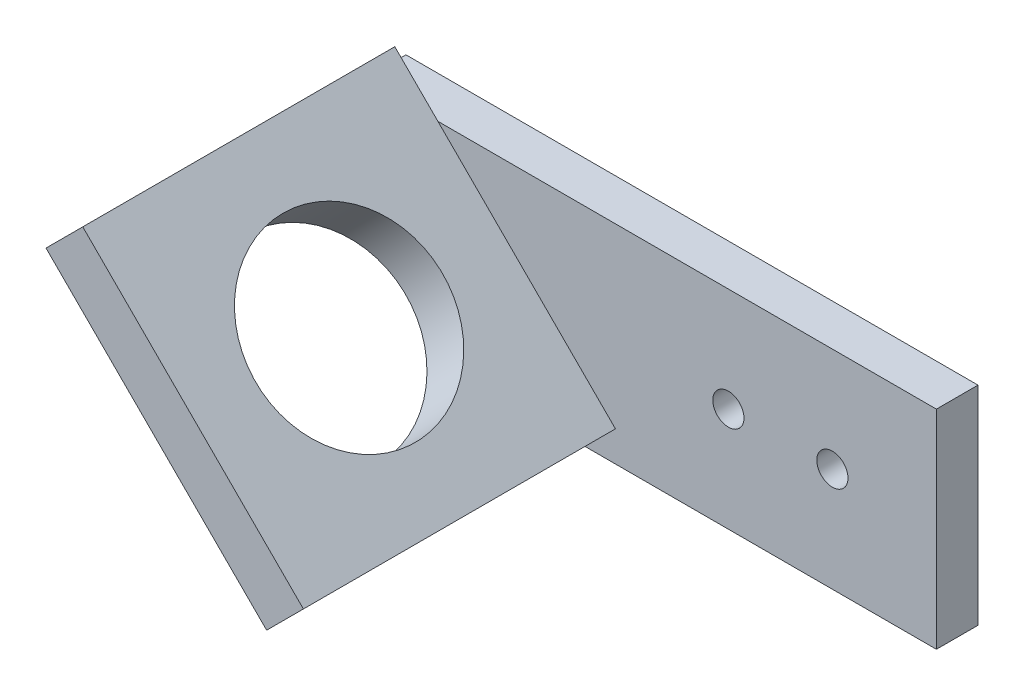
from build123d import *

# Parameters (mm, degrees)
SKETCH_1_W          = 80
SKETCH_1_H          = 20
EXTRUDE_1_DEPTH     = 4
EXTRUDE_2_DEPTH     = 30
SKETCH_3_R          = 9
CUT_EXTRUDE_1_DEPTH = 20
SKETCH_4_R          = 1.5
CUT_EXTRUDE_2_DEPTH = 20
CUT_EXTRUDE_3_DEPTH = 10


with BuildPart() as part:
    # Sketch 1 → Extrude 1 (new body)
    with BuildSketch(Plane.XY):
        Rectangle(SKETCH_1_W, SKETCH_1_H)
    extrude(amount=EXTRUDE_1_DEPTH)

    # Sketch 2 → Extrude 2 (add)
    with BuildSketch(Plane.XY.offset(4)):
        Polygon((-15.606601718, 10.606601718), (5.606601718, -10.606601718), (9.142135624, -7.071067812), (-12.071067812, 14.142135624), align=None)
    extrude(amount=EXTRUDE_2_DEPTH)

    # Sketch 3 → Cut-Extrude 1 (cut)
    with BuildSketch(Plane(origin=(1.035533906, 1.035533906, 0), x_dir=(0, 0, -1), z_dir=(0.7071067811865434, 0.7071067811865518, 0))):
        with Locations(Location((-19, 3.535533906, 0), (0, 0, 90))):
            Circle(SKETCH_3_R)
    extrude(amount=-CUT_EXTRUDE_1_DEPTH, mode=Mode.SUBTRACT)

    # Sketch 4 → Cut-Extrude 2 (cut)
    with BuildSketch(Plane.XY.offset(4)):
        with Locations((30, 0)):
            Circle(SKETCH_4_R)
        with Locations((20, 0)):
            Circle(SKETCH_4_R)
    extrude(amount=-CUT_EXTRUDE_2_DEPTH, mode=Mode.SUBTRACT)

    # Sketch 5 → Cut-Extrude 3 (cut)
    with BuildSketch(Plane.XY.offset(4)):
        Polygon((0, -5), (14.616197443, -19.616197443), (-46.670492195, -16.230640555), (-45.093479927, 12.317059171), (-15.606601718, 10.606601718), align=None)
    extrude(amount=-CUT_EXTRUDE_3_DEPTH, mode=Mode.SUBTRACT)


solid = part.part
